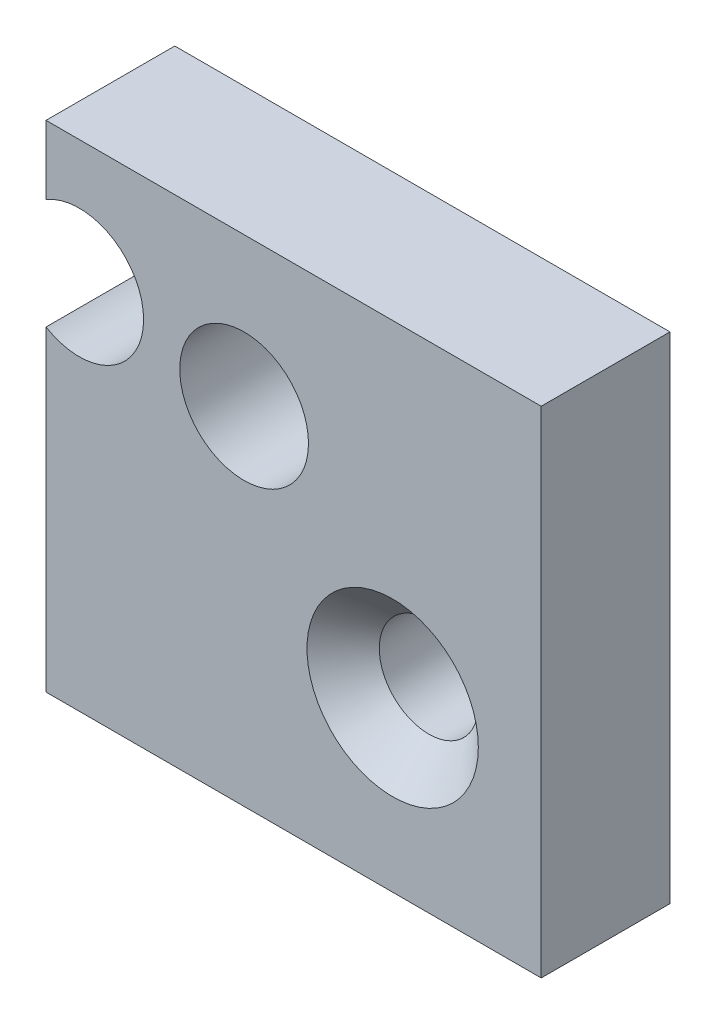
from build123d import *

# Parameters (mm, degrees)
SKIZZE1_W                                            = 50
SKIZZE1_H                                            = 50
LINEAR_AUSTRAGEN1_DEPTH                              = 13
M13_0_13_DURCHMESSER_BOHRUNG1_D                      = 13
FORMSENKUNG_F_R_M8_LINSENSENKSCHRAUBE_MI_D           = 10
FORMSENKUNG_F_R_M8_LINSENSENKSCHRAUBE_MI_CSINK_D     = 17.3
FORMSENKUNG_F_R_M8_LINSENSENKSCHRAUBE_MI_CSINK_ANGLE = 90


with BuildPart() as part:
    # Skizze1 → Linear austragen1 (new body)
    with BuildSketch(Plane.XY):
        Rectangle(SKIZZE1_W, SKIZZE1_H)
    extrude(amount=LINEAR_AUSTRAGEN1_DEPTH)

    # M13.0 _13_ Durchmesser Bohrung1 (through all)
    with Locations(Plane.XY.offset(13)):
        with Locations((-21.650635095, 12.5), (-5, 10)):
            Hole(M13_0_13_DURCHMESSER_BOHRUNG1_D / 2)

    # Formsenkung f_r M8 Linsensenkschraube mi (through all)
    with Locations(Plane.XY.offset(13)):
        with Locations((10, -8)):
            CounterSinkHole(FORMSENKUNG_F_R_M8_LINSENSENKSCHRAUBE_MI_D / 2, FORMSENKUNG_F_R_M8_LINSENSENKSCHRAUBE_MI_CSINK_D / 2, counter_sink_angle=FORMSENKUNG_F_R_M8_LINSENSENKSCHRAUBE_MI_CSINK_ANGLE)


solid = part.part
